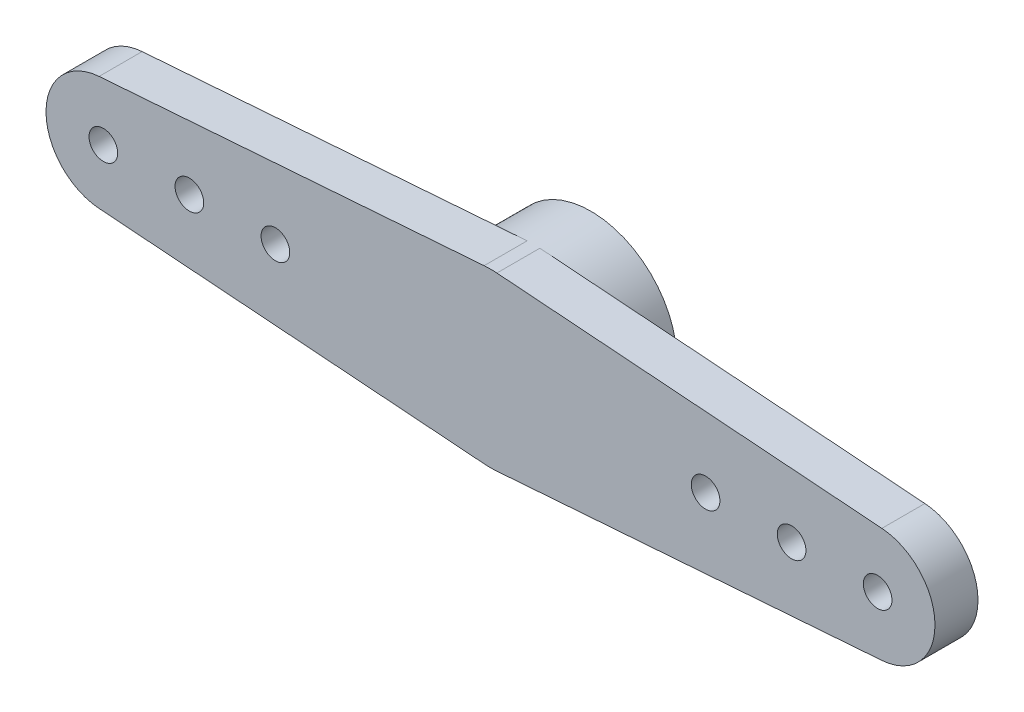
from build123d import *

# Parameters (mm, degrees)
ESQUISSE1_R           = 0.5
EXTRUSION6_DEPTH      = 1.5
EXTRUSION8_DEPTH      = 2
EXTRUSION8_DEPTH_BACK = 1.5
ESQUISSE3_R           = 3
ESQUISSE4_R           = 2
EXTRUSION9_DEPTH      = 2.6


with BuildPart() as part:
    # Esquisse1 → Extrusion6 (new body)
    with BuildSketch(Plane.XY):
        with BuildLine():
            Line((-13.648148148, 1.994505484), (-0.222222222, 2.991758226))
            ThreePointArc((-0.222222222, 2.991758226), (0, 3), (0.222222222, 2.991758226))
            Line((0.222222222, 2.991758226), (13.648148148, 1.994505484))
            ThreePointArc((13.648148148, 1.994505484), (15.5, 0), (13.648148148, -1.994505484))
            Line((13.648148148, -1.994505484), (0.222222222, -2.991758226))
            ThreePointArc((0.222222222, -2.991758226), (0, -3), (-0.222222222, -2.991758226))
            Line((-0.222222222, -2.991758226), (-13.648148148, -1.994505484))
            ThreePointArc((-13.648148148, -1.994505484), (-15.5, 0), (-13.648148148, 1.994505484))
        make_face()
        with Locations((-13.5, 0)):
            Circle(ESQUISSE1_R, mode=Mode.SUBTRACT)
        with Locations((-10.5, 0)):
            Circle(ESQUISSE1_R, mode=Mode.SUBTRACT)
        with Locations((-7.5, 0)):
            Circle(ESQUISSE1_R, mode=Mode.SUBTRACT)
        with Locations((7.5, 0)):
            Circle(ESQUISSE1_R, mode=Mode.SUBTRACT)
        with Locations((10.5, 0)):
            Circle(ESQUISSE1_R, mode=Mode.SUBTRACT)
        with Locations((13.5, 0)):
            Circle(ESQUISSE1_R, mode=Mode.SUBTRACT)
    extrude(amount=EXTRUSION6_DEPTH)

    # Esquisse3 → Extrusion8 (add, two sides: drawn at the far end of the back side and taken through both)
    with BuildSketch(Plane(origin=(0, 0, 0), x_dir=(-1, 0, 0), z_dir=(0, 0, -1)).offset(-EXTRUSION8_DEPTH_BACK)):
        Circle(ESQUISSE3_R)
    extrude(amount=EXTRUSION8_DEPTH + EXTRUSION8_DEPTH_BACK)

    # Esquisse4 → Extrusion9 (cut)
    with BuildSketch(Plane(origin=(0, 0, -2), x_dir=(-1, 0, 0), z_dir=(0, 0, -1))):
        Circle(ESQUISSE4_R)
    extrude(amount=-EXTRUSION9_DEPTH, mode=Mode.SUBTRACT)


solid = part.part
